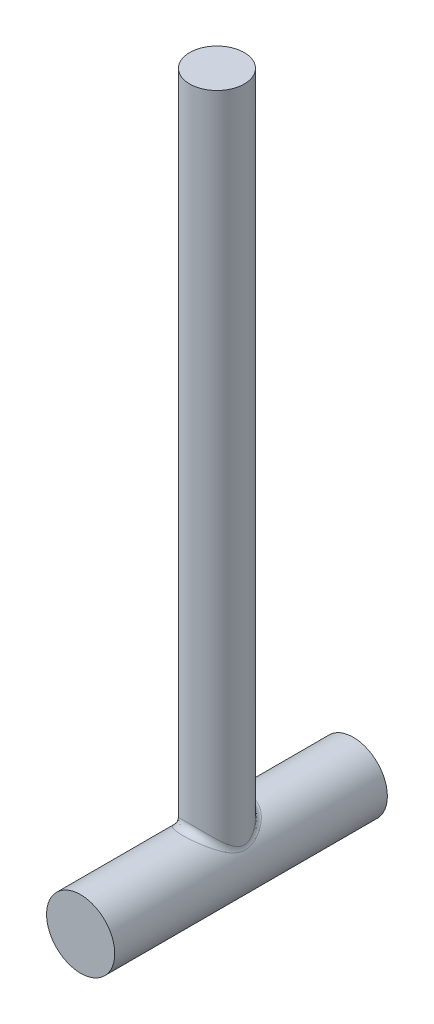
ISO-10303-21;
HEADER;
FILE_DESCRIPTION(('STEP AP214'),'2;1');
FILE_NAME('part.step','',(''),(''),'','','');
FILE_SCHEMA(('AUTOMOTIVE_DESIGN { 1 0 10303 214 1 1 1 1 }'));
ENDSEC;
DATA;
#1=APPLICATION_CONTEXT('core data for automotive mechanical design processes');
#2=APPLICATION_PROTOCOL_DEFINITION('international standard','automotive_design',2000,#1);
#3=PRODUCT_CONTEXT('',#1,'mechanical');
#4=PRODUCT('Part','Part','',(#3));
#5=PRODUCT_RELATED_PRODUCT_CATEGORY('part','',(#4));
#6=PRODUCT_DEFINITION_FORMATION('','',#4);
#7=PRODUCT_DEFINITION_CONTEXT('part definition',#1,'design');
#8=PRODUCT_DEFINITION('design','',#6,#7);
#9=PRODUCT_DEFINITION_SHAPE('','',#8);
#10=(LENGTH_UNIT() NAMED_UNIT(*) SI_UNIT(.MILLI.,.METRE.));
#11=(NAMED_UNIT(*) PLANE_ANGLE_UNIT() SI_UNIT($,.RADIAN.));
#12=(NAMED_UNIT(*) SI_UNIT($,.STERADIAN.) SOLID_ANGLE_UNIT());
#13=UNCERTAINTY_MEASURE_WITH_UNIT(LENGTH_MEASURE(1.E-05),#10,'distance_accuracy_value','');
#14=(GEOMETRIC_REPRESENTATION_CONTEXT(3) GLOBAL_UNCERTAINTY_ASSIGNED_CONTEXT((#13)) GLOBAL_UNIT_ASSIGNED_CONTEXT((#10,
#11,#12)) REPRESENTATION_CONTEXT('',''));
#15=CARTESIAN_POINT('',(0.,0.,0.));
#16=DIRECTION('',(0.,0.,1.));
#17=DIRECTION('',(1.,0.,0.));
#18=AXIS2_PLACEMENT_3D('',#15,#16,#17);
#19=CARTESIAN_POINT('',(0.,0.,20.));
#20=DIRECTION('',(0.,0.,-1.));
#21=DIRECTION('',(-1.,0.,0.));
#22=AXIS2_PLACEMENT_3D('',#19,#20,#21);
#23=CYLINDRICAL_SURFACE('',#22,5.);
#24=CARTESIAN_POINT('',(-0.656376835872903,4.95672971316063,-4.93757065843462));
#25=CARTESIAN_POINT('',(-0.504697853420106,4.97681524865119,-3.97006442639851));
#26=CARTESIAN_POINT('',(-0.630121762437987,5.94807565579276,-3.95005652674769));
#27=CARTESIAN_POINT('',(-0.464223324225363,4.98217229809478,-4.97435039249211));
#28=CARTESIAN_POINT('',(-0.352663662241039,4.99094800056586,-3.98829545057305));
#29=CARTESIAN_POINT('',(-0.44565439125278,5.97860675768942,-3.97948031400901));
#30=CARTESIAN_POINT('',(-0.268443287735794,4.99664556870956,-4.99516905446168));
#31=CARTESIAN_POINT('',(-0.20403773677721,4.99825251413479,-3.99774188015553));
#32=CARTESIAN_POINT('',(-0.257705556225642,5.99597468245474,-3.99613524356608));
#33=CARTESIAN_POINT('',(0.123945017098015,5.00231038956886,-5.00332749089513));
#34=CARTESIAN_POINT('',(0.0944058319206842,5.00120638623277,-4.00155886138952));
#35=CARTESIAN_POINT('',(0.118987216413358,6.00277246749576,-4.00266199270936));
#36=CARTESIAN_POINT('',(0.320553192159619,4.99350449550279,-4.99067094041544));
#37=CARTESIAN_POINT('',(0.242548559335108,4.99682462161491,-3.99588917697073));
#38=CARTESIAN_POINT('',(0.307731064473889,5.99220539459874,-3.99253675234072));
#39=CARTESIAN_POINT('',(0.693096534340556,4.95499917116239,-4.93508987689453));
#40=CARTESIAN_POINT('',(0.531937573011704,4.97600469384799,-3.96901749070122));
#41=CARTESIAN_POINT('',(0.665372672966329,5.94599900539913,-3.9480719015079));
#42=CARTESIAN_POINT('',(0.86946167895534,4.92695177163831,-4.89455803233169));
#43=CARTESIAN_POINT('',(0.671445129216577,4.96071031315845,-3.94928942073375));
#44=CARTESIAN_POINT('',(0.834683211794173,5.91234212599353,-3.91564642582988));
#45=CARTESIAN_POINT('',(1.21303128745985,4.85380602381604,-4.78816065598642));
#46=CARTESIAN_POINT('',(0.954268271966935,4.91716770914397,-3.89313869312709));
#47=CARTESIAN_POINT('',(1.16451003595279,5.82456722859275,-3.83052852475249));
#48=CARTESIAN_POINT('',(1.38023434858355,4.80870507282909,-4.72229125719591));
#49=CARTESIAN_POINT('',(1.09657196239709,4.88927170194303,-3.85717007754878));
#50=CARTESIAN_POINT('',(1.32502497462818,5.77044608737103,-3.77783300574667));
#51=CARTESIAN_POINT('',(1.71349895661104,4.70070856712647,-4.56305720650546));
#52=CARTESIAN_POINT('',(1.39163167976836,4.81687698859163,-3.7634632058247));
#53=CARTESIAN_POINT('',(1.64495899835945,5.64085028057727,-3.65044576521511));
#54=CARTESIAN_POINT('',(1.87871059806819,4.6368119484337,-4.46812812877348));
#55=CARTESIAN_POINT('',(1.54391894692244,4.7718539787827,-3.7050335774));
#56=CARTESIAN_POINT('',(1.80356217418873,5.56417433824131,-3.57450250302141));
#57=CARTESIAN_POINT('',(2.19339683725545,4.49653032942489,-4.25665468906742));
#58=CARTESIAN_POINT('',(1.844386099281,4.66600158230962,-3.5661683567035));
#59=CARTESIAN_POINT('',(2.10566096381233,5.39583639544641,-3.40532375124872));
#60=CARTESIAN_POINT('',(2.34285964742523,4.42013608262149,-4.14009431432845));
#61=CARTESIAN_POINT('',(1.99232649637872,4.60567561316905,-3.48642403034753));
#62=CARTESIAN_POINT('',(2.24914526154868,5.30416329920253,-3.3120754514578));
#63=CARTESIAN_POINT('',(2.69256281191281,4.21991137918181,-3.82848401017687));
#64=CARTESIAN_POINT('',(2.34544449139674,4.44025322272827,-3.26396071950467));
#65=CARTESIAN_POINT('',(2.58486029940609,5.06389365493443,-3.06278720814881));
#66=CARTESIAN_POINT('',(2.88311381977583,4.09080894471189,-3.62248098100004));
#67=CARTESIAN_POINT('',(2.54804891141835,4.32699518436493,-3.10882273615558));
#68=CARTESIAN_POINT('',(2.7677892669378,4.90897073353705,-2.89798478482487));
#69=CARTESIAN_POINT('',(3.14141504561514,3.8914607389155,-3.28824676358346));
#70=CARTESIAN_POINT('',(2.83053667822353,4.14238582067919,-2.8430824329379));
#71=CARTESIAN_POINT('',(3.01575844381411,4.6697528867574,-2.63059741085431));
#72=CARTESIAN_POINT('',(3.22303514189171,3.82395088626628,-3.17242705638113));
#73=CARTESIAN_POINT('',(2.92035982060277,4.0791190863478,-2.75012904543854));
#74=CARTESIAN_POINT('',(3.09411373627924,4.58874106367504,-2.53794164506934));
#75=CARTESIAN_POINT('',(3.37711116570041,3.68857656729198,-2.93255606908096));
#76=CARTESIAN_POINT('',(3.09131895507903,3.95023691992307,-2.5545809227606));
#77=CARTESIAN_POINT('',(3.24202671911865,4.42629188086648,-2.34604485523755));
#78=CARTESIAN_POINT('',(3.44956975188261,3.62071220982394,-2.80850719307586));
#79=CARTESIAN_POINT('',(3.1726917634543,3.88458585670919,-2.45202973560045));
#80=CARTESIAN_POINT('',(3.31158696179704,4.34485465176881,-2.24680575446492));
#81=CARTESIAN_POINT('',(3.57163265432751,3.49989695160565,-2.57784890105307));
#82=CARTESIAN_POINT('',(3.31078213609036,3.76613114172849,-2.25873473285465));
#83=CARTESIAN_POINT('',(3.42876734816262,4.19987634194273,-2.06227912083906));
#84=CARTESIAN_POINT('',(3.62291047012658,3.44667595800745,-2.47270834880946));
#85=CARTESIAN_POINT('',(3.36916059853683,3.71346435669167,-2.16993669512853));
#86=CARTESIAN_POINT('',(3.47799405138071,4.13601114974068,-1.97816667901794));
#87=CARTESIAN_POINT('',(3.71938308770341,3.34233908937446,-2.25705321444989));
#88=CARTESIAN_POINT('',(3.47940570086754,3.60943635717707,-1.98639252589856));
#89=CARTESIAN_POINT('',(3.57060776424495,4.01080690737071,-1.80564257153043));
#90=CARTESIAN_POINT('',(3.76457924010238,3.29122274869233,-2.14653983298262));
#91=CARTESIAN_POINT('',(3.53139751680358,3.55800753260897,-1.89161323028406));
#92=CARTESIAN_POINT('',(3.61399607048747,3.94946729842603,-1.717231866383));
#93=CARTESIAN_POINT('',(3.84855281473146,3.19262027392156,-1.92014399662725));
#94=CARTESIAN_POINT('',(3.62825545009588,3.45823376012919,-1.69625625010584));
#95=CARTESIAN_POINT('',(3.69461070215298,3.83114432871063,-1.53611519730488));
#96=CARTESIAN_POINT('',(3.88734472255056,3.14512608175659,-1.80427443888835));
#97=CARTESIAN_POINT('',(3.67325600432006,3.40979809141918,-1.59563376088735));
#98=CARTESIAN_POINT('',(3.73185093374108,3.77415129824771,-1.44341955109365));
#99=CARTESIAN_POINT('',(3.95819959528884,3.05547343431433,-1.56682411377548));
#100=CARTESIAN_POINT('',(3.75558814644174,3.31799967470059,-1.38847188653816));
#101=CARTESIAN_POINT('',(3.79987161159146,3.66656812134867,-1.25345929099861));
#102=CARTESIAN_POINT('',(3.99026650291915,3.0133118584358,-1.4452467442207));
#103=CARTESIAN_POINT('',(3.79303666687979,3.2745350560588,-1.28184494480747));
#104=CARTESIAN_POINT('',(3.83065584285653,3.61597423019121,-1.15619739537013));
#105=CARTESIAN_POINT('',(4.05471659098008,2.92625159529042,-1.16278607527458));
#106=CARTESIAN_POINT('',(3.86828981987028,3.18464055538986,-1.03348311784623));
#107=CARTESIAN_POINT('',(3.89252792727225,3.51150191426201,-0.930228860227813));
#108=CARTESIAN_POINT('',(4.08489217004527,2.88363485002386,-1.00008441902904));
#109=CARTESIAN_POINT('',(3.90377520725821,3.14023922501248,-0.889490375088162));
#110=CARTESIAN_POINT('',(3.92149648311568,3.46036181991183,-0.800067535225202));
#111=CARTESIAN_POINT('',(4.12008241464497,2.83290390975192,-0.750345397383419));
#112=CARTESIAN_POINT('',(3.94516185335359,3.08731330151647,-0.667774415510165));
#113=CARTESIAN_POINT('',(3.95527911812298,3.39948469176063,-0.60027631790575));
#114=CARTESIAN_POINT('',(4.13013044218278,2.81819780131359,-0.666206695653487));
#115=CARTESIAN_POINT('',(3.9569845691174,3.07195234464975,-0.593034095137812));
#116=CARTESIAN_POINT('',(3.96492522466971,3.38183736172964,-0.532965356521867));
#117=CARTESIAN_POINT('',(4.14669097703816,2.79377397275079,-0.49641412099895));
#118=CARTESIAN_POINT('',(3.97646622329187,3.04643699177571,-0.442107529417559));
#119=CARTESIAN_POINT('',(3.98082333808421,3.35252876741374,-0.397131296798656));
#120=CARTESIAN_POINT('',(4.15320524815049,2.78405376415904,-0.410761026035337));
#121=CARTESIAN_POINT('',(3.98414214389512,3.03626092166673,-0.365867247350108));
#122=CARTESIAN_POINT('',(3.98707703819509,3.3408645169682,-0.328608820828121));
#123=CARTESIAN_POINT('',(4.16258609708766,2.77000910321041,-0.237748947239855));
#124=CARTESIAN_POINT('',(3.9951893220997,3.02156378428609,-0.211839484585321));
#125=CARTESIAN_POINT('',(3.9960826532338,3.32401092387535,-0.190199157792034));
#126=CARTESIAN_POINT('',(4.16541950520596,2.76573372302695,-0.150381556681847));
#127=CARTESIAN_POINT('',(3.99853052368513,3.01708213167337,-0.133981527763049));
#128=CARTESIAN_POINT('',(3.99880272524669,3.31888046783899,-0.120305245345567));
#129=CARTESIAN_POINT('',(4.16725397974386,2.76296889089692,0.0245414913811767));
#130=CARTESIAN_POINT('',(4.00069184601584,3.0141866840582,0.0218548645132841));
#131=CARTESIAN_POINT('',(4.00056382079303,3.31556266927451,0.0196331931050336));
#132=CARTESIAN_POINT('',(4.16625519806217,2.76447920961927,0.112097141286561));
#133=CARTESIAN_POINT('',(3.9995139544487,3.01577022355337,0.0998984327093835));
#134=CARTESIAN_POINT('',(3.99960499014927,3.31737505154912,0.0896777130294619));
#135=CARTESIAN_POINT('',(4.16044963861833,2.77320862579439,0.286676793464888));
#136=CARTESIAN_POINT('',(3.99267498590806,3.02490969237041,0.255390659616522));
#137=CARTESIAN_POINT('',(3.99403165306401,3.32785035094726,0.229341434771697));
#138=CARTESIAN_POINT('',(4.15564001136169,2.78043199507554,0.37370034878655));
#139=CARTESIAN_POINT('',(3.98700486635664,3.0324776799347,0.33290305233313));
#140=CARTESIAN_POINT('',(3.98941441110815,3.33651839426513,0.298960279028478));
#141=CARTESIAN_POINT('',(4.14233780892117,2.80020991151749,0.546480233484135));
#142=CARTESIAN_POINT('',(3.97134796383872,3.05315812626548,0.486617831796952));
#143=CARTESIAN_POINT('',(3.97664429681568,3.36025189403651,0.437184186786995));
#144=CARTESIAN_POINT('',(4.13384317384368,2.81276744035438,0.632235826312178));
#145=CARTESIAN_POINT('',(3.96134622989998,3.06629001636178,0.562878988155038));
#146=CARTESIAN_POINT('',(3.968489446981,3.37532092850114,0.505788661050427));
#147=CARTESIAN_POINT('',(4.09884570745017,2.86380854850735,0.921942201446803));
#148=CARTESIAN_POINT('',(3.92013701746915,3.11963040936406,0.820471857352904));
#149=CARTESIAN_POINT('',(3.93489187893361,3.43657025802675,0.737553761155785));
#150=CARTESIAN_POINT('',(4.06386231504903,2.91384586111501,1.12158455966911));
#151=CARTESIAN_POINT('',(3.87890366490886,3.17190992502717,0.997460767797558));
#152=CARTESIAN_POINT('',(3.90130782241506,3.49661503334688,0.89726764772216));
#153=CARTESIAN_POINT('',(3.97639037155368,3.0321053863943,1.50715033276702));
#154=CARTESIAN_POINT('',(3.77667649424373,3.29412827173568,1.33681627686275));
#155=CARTESIAN_POINT('',(3.81733475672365,3.63852646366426,1.20572026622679));
#156=CARTESIAN_POINT('',(3.92384370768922,3.10038781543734,1.69302566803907));
#157=CARTESIAN_POINT('',(3.71524182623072,3.36451649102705,1.49960183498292));
#158=CARTESIAN_POINT('',(3.76688995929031,3.72046537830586,1.35442053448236));
#159=CARTESIAN_POINT('',(3.81592361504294,3.23178170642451,2.01371198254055));
#160=CARTESIAN_POINT('',(3.59047177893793,3.49808565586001,1.77747705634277));
#161=CARTESIAN_POINT('',(3.6632866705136,3.8781380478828,1.61096958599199));
#162=CARTESIAN_POINT('',(3.76342756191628,3.29299946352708,2.15108553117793));
#163=CARTESIAN_POINT('',(3.52983452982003,3.56003795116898,1.89588354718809));
#164=CARTESIAN_POINT('',(3.61289045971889,3.95159935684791,1.72086842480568));
#165=CARTESIAN_POINT('',(3.64927498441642,3.41906735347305,2.41779299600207));
#166=CARTESIAN_POINT('',(3.39905895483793,3.68622850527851,2.12371548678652));
#167=CARTESIAN_POINT('',(3.50330398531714,4.10288082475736,1.93423439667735));
#168=CARTESIAN_POINT('',(3.58761353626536,3.48391942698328,2.54712253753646));
#169=CARTESIAN_POINT('',(3.32869111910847,3.75059911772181,2.23321016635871));
#170=CARTESIAN_POINT('',(3.44410899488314,4.18070331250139,2.03769803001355));
#171=CARTESIAN_POINT('',(3.45536271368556,3.61512878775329,2.79805652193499));
#172=CARTESIAN_POINT('',(3.17923813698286,3.8791316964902,2.44330082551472));
#173=CARTESIAN_POINT('',(3.31714820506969,4.33815454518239,2.23844521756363));
#174=CARTESIAN_POINT('',(3.38476585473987,3.68148729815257,2.91965435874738));
#175=CARTESIAN_POINT('',(3.09991770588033,3.94337976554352,2.54390844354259));
#176=CARTESIAN_POINT('',(3.2493752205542,4.41778475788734,2.33572348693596));
#177=CARTESIAN_POINT('',(3.23478076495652,3.81395148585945,3.15500675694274));
#178=CARTESIAN_POINT('',(2.93336321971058,4.06965310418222,2.73600419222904));
#179=CARTESIAN_POINT('',(3.10538953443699,4.5767417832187,2.52400540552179));
#180=CARTESIAN_POINT('',(3.15538921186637,3.88005705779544,3.26875832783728));
#181=CARTESIAN_POINT('',(2.84590576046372,4.13171405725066,2.82745331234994));
#182=CARTESIAN_POINT('',(3.02917364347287,4.65606846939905,2.61500666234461));
#183=CARTESIAN_POINT('',(2.89872531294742,4.07986379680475,3.6047983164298));
#184=CARTESIAN_POINT('',(2.56461215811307,4.31730678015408,3.09538255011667));
#185=CARTESIAN_POINT('',(2.78277630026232,4.89583655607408,2.88383865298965));
#186=CARTESIAN_POINT('',(2.70702246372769,4.2108177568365,3.81410095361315));
#187=CARTESIAN_POINT('',(2.36028397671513,4.43258032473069,3.25347768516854));
#188=CARTESIAN_POINT('',(2.5987415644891,5.05298130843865,3.05128076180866));
#189=CARTESIAN_POINT('',(2.28683155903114,4.45298177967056,4.19142523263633));
#190=CARTESIAN_POINT('',(1.93287136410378,4.63423873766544,3.52499216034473));
#191=CARTESIAN_POINT('',(2.19535829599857,5.34357813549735,3.35314018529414));
#192=CARTESIAN_POINT('',(2.05843347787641,4.56423877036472,4.35954536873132));
#193=CARTESIAN_POINT('',(1.70914838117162,4.71950185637,3.63668322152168));
#194=CARTESIAN_POINT('',(1.97609613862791,5.47708652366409,3.48763629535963));
#195=CARTESIAN_POINT('',(1.62242003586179,4.73386922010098,4.61237196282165));
#196=CARTESIAN_POINT('',(1.30802655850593,4.84065732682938,3.79439253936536));
#197=CARTESIAN_POINT('',(1.55752323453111,5.68064306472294,3.68989756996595));
#198=CARTESIAN_POINT('',(1.42146183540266,4.79850025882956,4.70731220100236));
#199=CARTESIAN_POINT('',(1.13096002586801,4.88270716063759,3.84867481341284));
#200=CARTESIAN_POINT('',(1.36460336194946,5.75820031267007,3.76584975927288));
#201=CARTESIAN_POINT('',(1.10850727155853,4.87676336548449,4.82158858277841));
#202=CARTESIAN_POINT('',(0.868441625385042,4.93090253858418,3.91085115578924));
#203=CARTESIAN_POINT('',(1.06416698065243,5.85211603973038,3.85727086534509));
#204=CARTESIAN_POINT('',(1.00229410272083,4.8997341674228,4.85498747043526));
#205=CARTESIAN_POINT('',(0.781042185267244,4.94447833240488,3.92835628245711));
#206=CARTESIAN_POINT('',(0.962202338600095,5.87968100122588,3.88398997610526));
#207=CARTESIAN_POINT('',(0.786826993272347,4.93891643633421,4.91182499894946));
#208=CARTESIAN_POINT('',(0.607034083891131,4.96706037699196,3.95747947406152));
#209=CARTESIAN_POINT('',(0.75535391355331,5.92669972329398,3.92945999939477));
#210=CARTESIAN_POINT('',(0.677573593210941,4.95512909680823,4.93526539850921));
#211=CARTESIAN_POINT('',(0.520681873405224,4.97599401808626,3.96900395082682));
#212=CARTESIAN_POINT('',(0.650470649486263,5.94615491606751,3.94821231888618));
#213=CARTESIAN_POINT('',(0.38210513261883,4.98884610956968,4.98396212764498));
#214=CARTESIAN_POINT('',(0.289813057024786,4.99439469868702,3.99275153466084));
#215=CARTESIAN_POINT('',(0.366820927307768,5.98661533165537,3.98716970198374));
#216=CARTESIAN_POINT('',(0.193926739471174,4.99977508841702,4.99967674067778));
#217=CARTESIAN_POINT('',(0.147426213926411,4.99988483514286,3.99985162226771));
#218=CARTESIAN_POINT('',(0.186169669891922,5.9997301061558,3.99974139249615));
#219=CARTESIAN_POINT('',(-0.182392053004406,5.00021825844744,5.00031367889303));
#220=CARTESIAN_POINT('',(-0.138675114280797,5.00011171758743,4.00014392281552));
#221=CARTESIAN_POINT('',(-0.175096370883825,6.0002619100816,4.00025094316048));
#222=CARTESIAN_POINT('',(-0.370532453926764,4.98973549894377,4.98524038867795));
#223=CARTESIAN_POINT('',(-0.280912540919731,4.99484767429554,3.9933351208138));
#224=CARTESIAN_POINT('',(-0.355711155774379,5.98768259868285,3.98819231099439));
#225=CARTESIAN_POINT('',(-0.740686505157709,4.94833235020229,4.9254547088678));
#226=CARTESIAN_POINT('',(-0.569349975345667,4.97235143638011,3.96430407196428));
#227=CARTESIAN_POINT('',(-0.711059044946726,5.9379988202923,3.94036376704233));
#228=CARTESIAN_POINT('',(-0.922713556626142,4.91746021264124,4.88081229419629));
#229=CARTESIAN_POINT('',(-0.714159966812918,4.95536659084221,3.94240065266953));
#230=CARTESIAN_POINT('',(-0.885805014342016,5.90095225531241,3.90464983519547));
#231=CARTESIAN_POINT('',(-1.27650855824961,4.83771390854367,4.76466995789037));
#232=CARTESIAN_POINT('',(-1.00773995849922,4.9072563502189,3.88035348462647));
#233=CARTESIAN_POINT('',(-1.22544821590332,5.80525669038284,3.81173596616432));
#234=CARTESIAN_POINT('',(-1.44827270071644,4.78883310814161,4.69316013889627));
#235=CARTESIAN_POINT('',(-1.15542577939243,4.87653733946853,3.84073390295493));
#236=CARTESIAN_POINT('',(-1.39034179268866,5.74659972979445,3.75452811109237));
#237=CARTESIAN_POINT('',(-1.78490504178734,4.67407387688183,4.52351612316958));
#238=CARTESIAN_POINT('',(-1.45685716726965,4.79822273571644,3.73923988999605));
#239=CARTESIAN_POINT('',(-1.71350884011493,5.60888865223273,3.61881289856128));
#240=CARTESIAN_POINT('',(-1.9492419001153,4.60760614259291,4.42445115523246));
#241=CARTESIAN_POINT('',(-1.61005001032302,4.75053566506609,3.67724101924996));
#242=CARTESIAN_POINT('',(-1.87127222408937,5.52912737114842,3.53956092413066));
#243=CARTESIAN_POINT('',(-2.26173611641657,4.46254624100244,4.20488465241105));
#244=CARTESIAN_POINT('',(-1.91145470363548,4.63934265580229,3.530942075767));
#245=CARTESIAN_POINT('',(-2.17126667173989,5.35505548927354,3.36390772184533));
#246=CARTESIAN_POINT('',(-2.40988225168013,4.38394575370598,4.08436839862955));
#247=CARTESIAN_POINT('',(-2.05949505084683,4.57633632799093,3.44733612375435));
#248=CARTESIAN_POINT('',(-2.31348696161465,5.26073490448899,3.26749471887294));
#249=CARTESIAN_POINT('',(-2.75645893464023,4.17846550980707,3.76262091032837));
#250=CARTESIAN_POINT('',(-2.4123444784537,4.40439941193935,3.21490200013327));
#251=CARTESIAN_POINT('',(-2.64620057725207,5.01415861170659,3.01009672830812));
#252=CARTESIAN_POINT('',(-2.94491587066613,4.04651453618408,3.5504047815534));
#253=CARTESIAN_POINT('',(-2.61421183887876,4.28728427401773,3.05335617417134));
#254=CARTESIAN_POINT('',(-2.82711923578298,4.8558174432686,2.84032382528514));
#255=CARTESIAN_POINT('',(-3.19948763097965,3.84384807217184,3.20666589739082));
#256=CARTESIAN_POINT('',(-2.89424280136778,4.09790611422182,2.77775691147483));
#257=CARTESIAN_POINT('',(-3.07150812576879,4.61261768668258,2.56533271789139));
#258=CARTESIAN_POINT('',(-3.27975654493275,3.77539839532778,3.08765663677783));
#259=CARTESIAN_POINT('',(-2.9830531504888,4.03321917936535,2.681499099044));
#260=CARTESIAN_POINT('',(-3.14856628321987,4.53047807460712,2.47012530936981));
#261=CARTESIAN_POINT('',(-3.43092302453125,3.63856004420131,2.84126930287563));
#262=CARTESIAN_POINT('',(-3.15158971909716,3.90196555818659,2.4792340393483));
#263=CARTESIAN_POINT('',(-3.29368610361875,4.36627205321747,2.27301544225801));
#264=CARTESIAN_POINT('',(-3.50182373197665,3.57017135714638,2.71389405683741));
#265=CARTESIAN_POINT('',(-3.23156405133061,3.83534791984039,2.37325715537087));
#266=CARTESIAN_POINT('',(-3.36175078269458,4.28420562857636,2.17111524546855));
#267=CARTESIAN_POINT('',(-3.61789408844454,3.45194682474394,2.48295740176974));
#268=CARTESIAN_POINT('',(-3.36342515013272,3.71868838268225,2.17856609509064));
#269=CARTESIAN_POINT('',(-3.47317832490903,4.1423361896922,1.98636592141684));
#270=CARTESIAN_POINT('',(-3.66511484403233,3.40166589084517,2.38119523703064));
#271=CARTESIAN_POINT('',(-3.41735261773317,3.66867587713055,2.0922073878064));
#272=CARTESIAN_POINT('',(-3.51851025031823,4.08199906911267,1.90495618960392));
#273=CARTESIAN_POINT('',(-3.75397276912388,3.30334260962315,2.17273494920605));
#274=CARTESIAN_POINT('',(-3.51917140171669,3.57022124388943,1.91407509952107));
#275=CARTESIAN_POINT('',(-3.60381385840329,3.96401113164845,1.73818795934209));
#276=CARTESIAN_POINT('',(-3.79561127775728,3.25529972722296,2.06603801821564));
#277=CARTESIAN_POINT('',(-3.56717079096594,3.52171589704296,1.82226702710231));
#278=CARTESIAN_POINT('',(-3.64378682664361,3.90635967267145,1.65283041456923));
#279=CARTESIAN_POINT('',(-3.87298136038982,3.16285319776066,1.8477158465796));
#280=CARTESIAN_POINT('',(-3.65657349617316,3.42790027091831,1.63336908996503));
#281=CARTESIAN_POINT('',(-3.7180621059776,3.7954238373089,1.47817267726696));
#282=CARTESIAN_POINT('',(-3.9087258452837,3.11844170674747,1.73610207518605));
#283=CARTESIAN_POINT('',(-3.69809291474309,3.38250715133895,1.53623500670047));
#284=CARTESIAN_POINT('',(-3.75237681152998,3.74213004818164,1.38888166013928));
#285=CARTESIAN_POINT('',(-3.97400963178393,3.0348079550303,1.50765703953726));
#286=CARTESIAN_POINT('',(-3.77403750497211,3.29671511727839,1.33659129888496));
#287=CARTESIAN_POINT('',(-3.81504924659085,3.64176954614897,1.20612563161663));
#288=CARTESIAN_POINT('',(-4.00355211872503,2.99558303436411,1.39082849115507));
#289=CARTESIAN_POINT('',(-3.80856261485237,3.25622606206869,1.23399999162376));
#290=CARTESIAN_POINT('',(-3.84341003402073,3.594699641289,1.11266279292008));
#291=CARTESIAN_POINT('',(-4.06430635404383,2.9128741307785,1.11345498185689));
#292=CARTESIAN_POINT('',(-3.87953902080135,3.17074418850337,0.989898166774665));
#293=CARTESIAN_POINT('',(-3.90173409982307,3.49544895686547,0.890763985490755));
#294=CARTESIAN_POINT('',(-4.09302472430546,2.8720467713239,0.950888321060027));
#295=CARTESIAN_POINT('',(-3.91332737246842,3.12817194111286,0.845914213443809));
#296=CARTESIAN_POINT('',(-3.92930373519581,3.446456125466,0.760710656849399));
#297=CARTESIAN_POINT('',(-4.12603504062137,2.82421822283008,0.701632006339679));
#298=CARTESIAN_POINT('',(-3.95216153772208,3.07824787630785,0.624522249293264));
#299=CARTESIAN_POINT('',(-3.96099363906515,3.38906186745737,0.561305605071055));
#300=CARTESIAN_POINT('',(-4.13535799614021,2.8105150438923,0.617698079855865));
#301=CARTESIAN_POINT('',(-3.96313432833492,3.06392750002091,0.549929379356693));
#302=CARTESIAN_POINT('',(-3.9699436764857,3.37261805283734,0.494158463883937));
#303=CARTESIAN_POINT('',(-4.15048007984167,2.78813545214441,0.448434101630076));
#304=CARTESIAN_POINT('',(-3.98092802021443,3.04053859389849,0.39941753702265));
#305=CARTESIAN_POINT('',(-3.98446087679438,3.34576254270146,0.358747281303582));
#306=CARTESIAN_POINT('',(-4.15628094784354,2.7794565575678,0.363104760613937));
#307=CARTESIAN_POINT('',(-3.98776455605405,3.0314499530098,0.323444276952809));
#308=CARTESIAN_POINT('',(-3.99002970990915,3.33534786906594,0.290483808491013));
#309=CARTESIAN_POINT('',(-4.16425143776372,2.76750124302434,0.190959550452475));
#310=CARTESIAN_POINT('',(-3.99715205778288,3.01893661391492,0.170158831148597));
#311=CARTESIAN_POINT('',(-3.997681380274,3.32100149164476,0.152767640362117));
#312=CARTESIAN_POINT('',(-4.16639145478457,2.76426887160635,0.104137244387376));
#313=CARTESIAN_POINT('',(-3.99967573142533,3.01554794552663,0.0927787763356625));
#314=CARTESIAN_POINT('',(-3.99973579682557,3.3171226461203,0.0833097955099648));
#315=CARTESIAN_POINT('',(-4.16689205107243,2.76351422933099,-0.0695562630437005));
#316=CARTESIAN_POINT('',(-4.00026554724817,3.01475763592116,-0.0619660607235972));
#317=CARTESIAN_POINT('',(-4.00021636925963,3.31621707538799,-0.0556450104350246));
#318=CARTESIAN_POINT('',(-4.16525273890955,2.76599179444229,-0.156427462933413));
#319=CARTESIAN_POINT('',(-3.9983323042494,3.01735516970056,-0.139394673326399));
#320=CARTESIAN_POINT('',(-3.99864262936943,3.31919015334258,-0.12514197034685));
#321=CARTESIAN_POINT('',(-4.15823470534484,2.77653080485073,-0.329537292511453));
#322=CARTESIAN_POINT('',(-3.99006578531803,3.02838758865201,-0.293557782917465));
#323=CARTESIAN_POINT('',(-3.99190531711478,3.33183696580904,-0.263629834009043));
#324=CARTESIAN_POINT('',(-4.15285261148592,2.7845972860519,-0.415775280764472));
#325=CARTESIAN_POINT('',(-3.98372179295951,3.03683671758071,-0.370353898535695));
#326=CARTESIAN_POINT('',(-3.98673850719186,3.34151674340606,-0.332620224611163));
#327=CARTESIAN_POINT('',(-4.13848494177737,2.80590551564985,-0.586900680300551));
#328=CARTESIAN_POINT('',(-3.96681369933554,3.05911125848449,-0.522556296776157));
#329=CARTESIAN_POINT('',(-3.97294554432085,3.36708661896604,-0.469520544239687));
#330=CARTESIAN_POINT('',(-4.12949734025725,2.81915017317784,-0.67178730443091));
#331=CARTESIAN_POINT('',(-3.95623399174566,3.07295683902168,-0.598019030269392));
#332=CARTESIAN_POINT('',(-3.96431744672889,3.38298020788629,-0.53742984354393));
#333=CARTESIAN_POINT('',(-4.09233288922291,2.87315002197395,-0.963356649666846));
#334=CARTESIAN_POINT('',(-3.91247889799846,3.12937069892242,-0.857199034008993));
#335=CARTESIAN_POINT('',(-3.92863957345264,3.4477800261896,-0.770685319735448));
#336=CARTESIAN_POINT('',(-4.05538054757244,2.9257073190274,-1.16544706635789));
#337=CARTESIAN_POINT('',(-3.86893777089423,3.18424462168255,-1.03624163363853));
#338=CARTESIAN_POINT('',(-3.8931653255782,3.51084878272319,-0.932357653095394));
#339=CARTESIAN_POINT('',(-3.98661470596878,3.01800960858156,-1.45750094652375));
#340=CARTESIAN_POINT('',(-3.78882243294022,3.27931433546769,-1.29242457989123));
#341=CARTESIAN_POINT('',(-3.82715011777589,3.62161153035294,-1.16600075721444));
#342=CARTESIAN_POINT('',(-3.96140541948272,3.05110192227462,-1.55318713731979));
#343=CARTESIAN_POINT('',(-3.7594034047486,3.31340529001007,-1.37631926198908));
#344=CARTESIAN_POINT('',(-3.80294920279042,3.66132230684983,-1.24254970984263));
#345=CARTESIAN_POINT('',(-3.90679871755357,3.12071820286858,-1.74098403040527));
#346=CARTESIAN_POINT('',(-3.69590763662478,3.38476720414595,-1.54032752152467));
#347=CARTESIAN_POINT('',(-3.75052676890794,3.74486184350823,-1.39278722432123));
#348=CARTESIAN_POINT('',(-3.87740242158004,3.15724125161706,-1.83309568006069));
#349=CARTESIAN_POINT('',(-3.66177756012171,3.42208643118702,-1.62048900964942));
#350=CARTESIAN_POINT('',(-3.72230632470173,3.78868950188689,-1.46647654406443));
#351=CARTESIAN_POINT('',(-3.79662194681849,3.25447718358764,-2.06570561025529));
#352=CARTESIAN_POINT('',(-3.56818186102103,3.52107063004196,-1.82236417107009));
#353=CARTESIAN_POINT('',(-3.64475706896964,3.90537262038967,-1.65256448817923));
#354=CARTESIAN_POINT('',(-3.74230380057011,3.31703899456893,-2.20362093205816));
#355=CARTESIAN_POINT('',(-3.50552221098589,3.58424984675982,-1.94100045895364));
#356=CARTESIAN_POINT('',(-3.59261164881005,3.98044679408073,-1.76289674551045));
#357=CARTESIAN_POINT('',(-3.624359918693,3.44552454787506,-2.47125473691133));
#358=CARTESIAN_POINT('',(-3.3706216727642,3.71253382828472,-2.1690799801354));
#359=CARTESIAN_POINT('',(-3.47938552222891,4.13462945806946,-1.97700378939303));
#360=CARTESIAN_POINT('',(-3.56072930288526,3.51145004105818,-2.60096887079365));
#361=CARTESIAN_POINT('',(-3.29814295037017,3.77776893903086,-2.27858671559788));
#362=CARTESIAN_POINT('',(-3.41830013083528,4.21374004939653,-2.08077509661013));
#363=CARTESIAN_POINT('',(-3.42434470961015,3.64457825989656,-2.85252423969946));
#364=CARTESIAN_POINT('',(-3.14436841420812,3.90771510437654,-2.48849691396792));
#365=CARTESIAN_POINT('',(-3.28737092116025,4.37349391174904,-2.28201939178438));
#366=CARTESIAN_POINT('',(-3.35158237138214,3.71178210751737,-2.97435810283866));
#367=CARTESIAN_POINT('',(-3.06282868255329,3.97250797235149,-2.5889038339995));
#368=CARTESIAN_POINT('',(-3.21751907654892,4.45413852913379,-2.37948648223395));
#369=CARTESIAN_POINT('',(-3.19706603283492,3.84567805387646,-3.20996836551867));
#370=CARTESIAN_POINT('',(-2.89178030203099,4.09952600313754,-2.780338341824));
#371=CARTESIAN_POINT('',(-3.06918339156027,4.61481366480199,-2.56797469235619));
#372=CARTESIAN_POINT('',(-3.11530879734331,3.912369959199,-3.32374184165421));
#373=CARTESIAN_POINT('',(-2.80204304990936,4.16177946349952,-2.87131672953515));
#374=CARTESIAN_POINT('',(-2.9906964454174,4.69484395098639,-2.65899347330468));
#375=CARTESIAN_POINT('',(-2.85181181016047,4.11299462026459,-3.65852047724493));
#376=CARTESIAN_POINT('',(-2.51444200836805,4.34692930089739,-3.13663713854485));
#377=CARTESIAN_POINT('',(-2.73773933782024,4.93559354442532,-2.92681638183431));
#378=CARTESIAN_POINT('',(-2.65546579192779,4.24376093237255,-3.86624690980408));
#379=CARTESIAN_POINT('',(-2.30630250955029,4.46096614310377,-3.29217726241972));
#380=CARTESIAN_POINT('',(-2.54924716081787,5.09251312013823,-3.09299752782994));
#381=CARTESIAN_POINT('',(-2.22558508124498,4.48408783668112,-4.23884390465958));
#382=CARTESIAN_POINT('',(-1.87229371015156,4.65885264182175,-3.55749362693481));
#383=CARTESIAN_POINT('',(-2.13656167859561,5.38090540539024,-3.39107512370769));
#384=CARTESIAN_POINT('',(-1.99217553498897,4.59371713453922,-4.40385393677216));
#385=CARTESIAN_POINT('',(-1.64593408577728,4.74150350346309,-3.66546596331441));
#386=CARTESIAN_POINT('',(-1.91248851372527,5.51246056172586,-3.52308314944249));
#387=CARTESIAN_POINT('',(-1.57408131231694,4.74916021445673,-4.63480948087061));
#388=CARTESIAN_POINT('',(-1.26598644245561,4.85046500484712,-3.8070305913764));
#389=CARTESIAN_POINT('',(-1.51111805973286,5.69899225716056,-3.7078475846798));
#390=CARTESIAN_POINT('',(-1.39843980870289,4.80411775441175,-4.71550319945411));
#391=CARTESIAN_POINT('',(-1.11201153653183,4.88608160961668,-3.85301972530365));
#392=CARTESIAN_POINT('',(-1.34250221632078,5.76494130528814,-3.77240255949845));
#393=CARTESIAN_POINT('',(-1.03518171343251,4.89523719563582,-4.84857440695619));
#394=CARTESIAN_POINT('',(-0.805558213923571,4.94255135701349,-3.92588749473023));
#395=CARTESIAN_POINT('',(-0.993774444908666,5.87428463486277,-3.87885952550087));
#396=CARTESIAN_POINT('',(-0.847574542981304,4.93141368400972,-4.90097387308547));
#397=CARTESIAN_POINT('',(-0.654197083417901,4.96291814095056,-3.95213737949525));
#398=CARTESIAN_POINT('',(-0.813671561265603,5.91769642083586,-3.92077909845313));
#399=CARTESIAN_POINT('',(-0.656376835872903,4.95672971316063,-4.93757065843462));
#400=CARTESIAN_POINT('',(-0.504697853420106,4.97681524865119,-3.97006442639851));
#401=CARTESIAN_POINT('',(-0.630121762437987,5.94807565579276,-3.95005652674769));
#402=(BOUNDED_SURFACE() B_SPLINE_SURFACE(3,2,((#24,#25,#26),(#27,#28,#29),(#30,#31,#32),(#33,
#34,#35),(#36,#37,#38),(#39,#40,#41),(#42,#43,#44),(#45,#46,#47),(#48,#49,#50),(#51,#52,#53),
(#54,#55,#56),(#57,#58,#59),(#60,#61,#62),(#63,#64,#65),(#66,#67,#68),(#69,#70,#71),(#72,#73,
#74),(#75,#76,#77),(#78,#79,#80),(#81,#82,#83),(#84,#85,#86),(#87,#88,#89),(#90,#91,#92),(#93,
#94,#95),(#96,#97,#98),(#99,#100,#101),(#102,#103,#104),(#105,#106,#107),(#108,#109,#110),(#111,
#112,#113),(#114,#115,#116),(#117,#118,#119),(#120,#121,#122),(#123,#124,#125),(#126,#127,#128),
(#129,#130,#131),(#132,#133,#134),(#135,#136,#137),(#138,#139,#140),(#141,#142,#143),(#144,#145,
#146),(#147,#148,#149),(#150,#151,#152),(#153,#154,#155),(#156,#157,#158),(#159,#160,#161),
(#162,#163,#164),(#165,#166,#167),(#168,#169,#170),(#171,#172,#173),(#174,#175,#176),(#177,#178,
#179),(#180,#181,#182),(#183,#184,#185),(#186,#187,#188),(#189,#190,#191),(#192,#193,#194),
(#195,#196,#197),(#198,#199,#200),(#201,#202,#203),(#204,#205,#206),(#207,#208,#209),(#210,#211,
#212),(#213,#214,#215),(#216,#217,#218),(#219,#220,#221),(#222,#223,#224),(#225,#226,#227),
(#228,#229,#230),(#231,#232,#233),(#234,#235,#236),(#237,#238,#239),(#240,#241,#242),(#243,#244,
#245),(#246,#247,#248),(#249,#250,#251),(#252,#253,#254),(#255,#256,#257),(#258,#259,#260),
(#261,#262,#263),(#264,#265,#266),(#267,#268,#269),(#270,#271,#272),(#273,#274,#275),(#276,#277,
#278),(#279,#280,#281),(#282,#283,#284),(#285,#286,#287),(#288,#289,#290),(#291,#292,#293),
(#294,#295,#296),(#297,#298,#299),(#300,#301,#302),(#303,#304,#305),(#306,#307,#308),(#309,#310,
#311),(#312,#313,#314),(#315,#316,#317),(#318,#319,#320),(#321,#322,#323),(#324,#325,#326),
(#327,#328,#329),(#330,#331,#332),(#333,#334,#335),(#336,#337,#338),(#339,#340,#341),(#342,#343,
#344),(#345,#346,#347),(#348,#349,#350),(#351,#352,#353),(#354,#355,#356),(#357,#358,#359),
(#360,#361,#362),(#363,#364,#365),(#366,#367,#368),(#369,#370,#371),(#372,#373,#374),(#375,#376,
#377),(#378,#379,#380),(#381,#382,#383),(#384,#385,#386),(#387,#388,#389),(#390,#391,#392),
(#393,#394,#395),(#396,#397,#398),(#399,#400,#401)),.UNSPECIFIED.,.T.,.F.,
.F.) B_SPLINE_SURFACE_WITH_KNOTS((4,2,2,2,2,2,2,2,2,2,2,2,2,2,2,2,2,2,2,2,2,2,2,2,2,2,2,2,2,2,2,
2,2,2,2,2,2,2,2,2,2,2,2,2,2,2,2,2,2,2,2,2,2,2,2,2,2,2,2,2,2,2,4),(3,3),(0.,0.705541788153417,
1.4110061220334,2.06243452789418,2.71396239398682,3.40977056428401,4.1060958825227,
5.13383226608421,5.64933447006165,6.1646867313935,6.57705185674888,6.9893252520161,
7.40065296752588,7.81173885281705,8.33273201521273,8.59289740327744,8.85293281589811,
9.11529561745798,9.37764801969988,9.64019677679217,9.90289248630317,10.5369913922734,
11.1732095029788,11.6766816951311,12.1804253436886,12.6845937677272,13.1889532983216,
14.2287829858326,15.2661009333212,16.072947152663,16.4761933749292,16.8793683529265,
17.5558655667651,18.2322664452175,18.9070723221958,19.5821270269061,20.2835469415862,
20.9854500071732,22.0240928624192,22.5449487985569,23.0656296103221,23.4589065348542,
23.8520889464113,24.2443983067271,24.6365056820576,25.154141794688,25.4126463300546,
25.6710230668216,25.9314795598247,26.1919285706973,26.4526125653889,26.7134432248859,
27.3581049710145,27.681744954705,28.0052985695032,28.5146188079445,29.0242069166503,
29.5342650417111,30.0445072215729,31.0921910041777,32.1364096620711,32.8389884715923,
33.5410207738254),(0.,1.),
.UNSPECIFIED.) GEOMETRIC_REPRESENTATION_ITEM() RATIONAL_B_SPLINE_SURFACE(((1.,0.714380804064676,
1.),(1.,0.710145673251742,1.),(1.,0.707675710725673,1.),(1.,0.706715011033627,1.),(1.,
0.708223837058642,1.),(1.,0.7146799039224,1.),(1.,0.719354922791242,1.),(1.,0.731190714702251,
1.),(1.,0.738351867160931,1.),(1.,0.754868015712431,1.),(1.,0.764339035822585,1.),(1.,
0.784198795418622,1.),(1.,0.794588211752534,1.),(1.,0.820479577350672,1.),(1.,0.836061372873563,
1.),(1.,0.858326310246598,1.),(1.,0.865573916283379,1.),(1.,0.879558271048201,1.),(1.,
0.886295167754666,1.),(1.,0.897838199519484,1.),(1.,0.902761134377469,1.),(1.,0.912128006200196,
1.),(1.,0.916572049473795,1.),(1.,0.924904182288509,1.),(1.,0.92879352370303,1.),(1.,
0.935948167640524,1.),(1.,0.939213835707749,1.),(1.,0.94581168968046,1.),(1.,0.948928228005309,
1.),(1.,0.952575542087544,1.),(1.,0.953619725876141,1.),(1.,0.955342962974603,1.),(1.,
0.956022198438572,1.),(1.,0.957000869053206,1.),(1.,0.957296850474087,1.),(1.,0.95748844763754,
1.),(1.,0.957384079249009,1.),(1.,0.95677796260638,1.),(1.,0.956275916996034,1.),(1.,
0.954889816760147,1.),(1.,0.954005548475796,1.),(1.,0.950370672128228,1.),(1.,0.946748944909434,
1.),(1.,0.93779235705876,1.),(1.,0.932451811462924,1.),(1.,0.921650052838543,1.),(1.,
0.916446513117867,1.),(1.,0.905298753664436,1.),(1.,0.899354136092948,1.),(1.,0.886838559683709,
1.),(1.,0.880267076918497,1.),(1.,0.866627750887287,1.),(1.,0.85955972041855,1.),(1.,
0.837354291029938,1.),(1.,0.821616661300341,1.),(1.,0.790377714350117,1.),(1.,0.774875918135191,
1.),(1.,0.74995245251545,1.),(1.,0.739945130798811,1.),(1.,0.727493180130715,1.),(1.,
0.723769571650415,1.),(1.,0.717349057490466,1.),(1.,0.714651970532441,1.),(1.,0.709013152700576,
1.),(1.,0.707145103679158,1.),(1.,0.707069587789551,1.),(1.,0.708861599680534,1.),(1.,
0.71579112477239,1.),(1.,0.72092073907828,1.),(1.,0.733753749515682,1.),(1.,0.74145809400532,
1.),(1.,0.758835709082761,1.),(1.,0.768574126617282,1.),(1.,0.788851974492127,1.),(1.,
0.799391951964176,1.),(1.,0.82556951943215,1.),(1.,0.841226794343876,1.),(1.,0.863462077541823,
1.),(1.,0.870675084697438,1.),(1.,0.884544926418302,1.),(1.,0.891201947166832,1.),(1.,
0.902276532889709,1.),(1.,0.906843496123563,1.),(1.,0.915525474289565,1.),(1.,0.919640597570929,
1.),(1.,0.927350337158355,1.),(1.,0.930946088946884,1.),(1.,0.937556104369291,1.),(1.,
0.940570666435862,1.),(1.,0.946799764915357,1.),(1.,0.949769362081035,1.),(1.,0.953193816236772,
1.),(1.,0.954163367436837,1.),(1.,0.955737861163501,1.),(1.,0.956342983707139,1.),(1.,
0.957174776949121,1.),(1.,0.957398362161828,1.),(1.,0.957450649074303,1.),(1.,0.9572793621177,
1.),(1.,0.95654681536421,1.),(1.,0.955985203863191,1.),(1.,0.954488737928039,1.),(1.,
0.95355367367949,1.),(1.,0.949696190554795,1.),(1.,0.945874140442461,1.),(1.,0.938843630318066,
1.),(1.,0.936277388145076,1.),(1.,0.93075428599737,1.),(1.,0.92779753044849,1.),(1.,
0.919733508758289,1.),(1.,0.914366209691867,1.),(1.,0.902891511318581,1.),(1.,0.8967837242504,
1.),(1.,0.883943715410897,1.),(1.,0.877210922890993,1.),(1.,0.863258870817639,1.),(1.,
0.856039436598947,1.),(1.,0.833460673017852,1.),(1.,0.81753717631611,1.),(1.,0.78614351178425,
1.),(1.,0.770672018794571,1.),(1.,0.74758102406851,1.),(1.,0.73904866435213,1.),(1.,
0.724556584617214,1.),(1.,0.718594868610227,1.),(1.,0.714380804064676,1.))) REPRESENTATION_ITEM('') SURFACE());
#403=CARTESIAN_POINT('',(-0.656376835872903,4.95672971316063,-4.93757065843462));
#404=CARTESIAN_POINT('',(-0.464223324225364,4.98217229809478,-4.97435039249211));
#405=CARTESIAN_POINT('',(-0.268443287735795,4.99664556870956,-4.99516905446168));
#406=CARTESIAN_POINT('',(0.123945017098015,5.00231038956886,-5.00332749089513));
#407=CARTESIAN_POINT('',(0.320553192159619,4.99350449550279,-4.99067094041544));
#408=CARTESIAN_POINT('',(0.693096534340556,4.95499917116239,-4.93508987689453));
#409=CARTESIAN_POINT('',(0.86946167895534,4.92695177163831,-4.89455803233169));
#410=CARTESIAN_POINT('',(1.21303128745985,4.85380602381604,-4.78816065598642));
#411=CARTESIAN_POINT('',(1.38023434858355,4.80870507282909,-4.72229125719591));
#412=CARTESIAN_POINT('',(1.71349895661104,4.70070856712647,-4.56305720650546));
#413=CARTESIAN_POINT('',(1.87871059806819,4.6368119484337,-4.46812812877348));
#414=CARTESIAN_POINT('',(2.19339683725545,4.49653032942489,-4.25665468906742));
#415=CARTESIAN_POINT('',(2.34285964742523,4.42013608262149,-4.14009431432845));
#416=CARTESIAN_POINT('',(2.69256281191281,4.21991137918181,-3.82848401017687));
#417=CARTESIAN_POINT('',(2.88311381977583,4.09080894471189,-3.62248098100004));
#418=CARTESIAN_POINT('',(3.14141504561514,3.8914607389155,-3.28824676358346));
#419=CARTESIAN_POINT('',(3.22303514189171,3.82395088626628,-3.17242705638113));
#420=CARTESIAN_POINT('',(3.37711116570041,3.68857656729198,-2.93255606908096));
#421=CARTESIAN_POINT('',(3.44956975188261,3.62071220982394,-2.80850719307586));
#422=CARTESIAN_POINT('',(3.57163265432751,3.49989695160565,-2.57784890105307));
#423=CARTESIAN_POINT('',(3.62291047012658,3.44667595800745,-2.47270834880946));
#424=CARTESIAN_POINT('',(3.71938308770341,3.34233908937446,-2.25705321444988));
#425=CARTESIAN_POINT('',(3.76457924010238,3.29122274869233,-2.14653983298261));
#426=CARTESIAN_POINT('',(3.84855281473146,3.19262027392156,-1.92014399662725));
#427=CARTESIAN_POINT('',(3.88734472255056,3.14512608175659,-1.80427443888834));
#428=CARTESIAN_POINT('',(3.95819959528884,3.05547343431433,-1.56682411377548));
#429=CARTESIAN_POINT('',(3.99026650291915,3.0133118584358,-1.4452467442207));
#430=CARTESIAN_POINT('',(4.05471659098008,2.92625159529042,-1.16278607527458));
#431=CARTESIAN_POINT('',(4.08489217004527,2.88363485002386,-1.00008441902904));
#432=CARTESIAN_POINT('',(4.12008241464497,2.83290390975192,-0.750345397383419));
#433=CARTESIAN_POINT('',(4.13013044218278,2.81819780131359,-0.666206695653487));
#434=CARTESIAN_POINT('',(4.14669097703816,2.79377397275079,-0.49641412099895));
#435=CARTESIAN_POINT('',(4.15320524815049,2.78405376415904,-0.410761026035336));
#436=CARTESIAN_POINT('',(4.16258609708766,2.77000910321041,-0.237748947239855));
#437=CARTESIAN_POINT('',(4.16541950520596,2.76573372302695,-0.150381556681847));
#438=CARTESIAN_POINT('',(4.16725397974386,2.76296889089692,0.0245414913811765));
#439=CARTESIAN_POINT('',(4.16625519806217,2.76447920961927,0.112097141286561));
#440=CARTESIAN_POINT('',(4.16044963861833,2.77320862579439,0.286676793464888));
#441=CARTESIAN_POINT('',(4.15564001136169,2.78043199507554,0.37370034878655));
#442=CARTESIAN_POINT('',(4.14233780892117,2.80020991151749,0.546480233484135));
#443=CARTESIAN_POINT('',(4.13384317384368,2.81276744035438,0.632235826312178));
#444=CARTESIAN_POINT('',(4.09884570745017,2.86380854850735,0.921942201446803));
#445=CARTESIAN_POINT('',(4.06386231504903,2.91384586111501,1.12158455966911));
#446=CARTESIAN_POINT('',(3.97639037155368,3.0321053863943,1.50715033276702));
#447=CARTESIAN_POINT('',(3.92384370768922,3.10038781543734,1.69302566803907));
#448=CARTESIAN_POINT('',(3.81592361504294,3.23178170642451,2.01371198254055));
#449=CARTESIAN_POINT('',(3.76342756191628,3.29299946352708,2.15108553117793));
#450=CARTESIAN_POINT('',(3.64927498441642,3.41906735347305,2.41779299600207));
#451=CARTESIAN_POINT('',(3.58761353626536,3.48391942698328,2.54712253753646));
#452=CARTESIAN_POINT('',(3.45536271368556,3.61512878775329,2.79805652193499));
#453=CARTESIAN_POINT('',(3.38476585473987,3.68148729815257,2.91965435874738));
#454=CARTESIAN_POINT('',(3.23478076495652,3.81395148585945,3.15500675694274));
#455=CARTESIAN_POINT('',(3.15538921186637,3.88005705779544,3.26875832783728));
#456=CARTESIAN_POINT('',(2.89872531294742,4.07986379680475,3.6047983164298));
#457=CARTESIAN_POINT('',(2.70702246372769,4.2108177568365,3.81410095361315));
#458=CARTESIAN_POINT('',(2.28683155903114,4.45298177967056,4.19142523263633));
#459=CARTESIAN_POINT('',(2.05843347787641,4.56423877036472,4.35954536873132));
#460=CARTESIAN_POINT('',(1.62242003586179,4.73386922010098,4.61237196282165));
#461=CARTESIAN_POINT('',(1.42146183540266,4.79850025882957,4.70731220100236));
#462=CARTESIAN_POINT('',(1.10850727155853,4.87676336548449,4.82158858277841));
#463=CARTESIAN_POINT('',(1.00229410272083,4.8997341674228,4.85498747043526));
#464=CARTESIAN_POINT('',(0.786826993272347,4.93891643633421,4.91182499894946));
#465=CARTESIAN_POINT('',(0.677573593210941,4.95512909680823,4.93526539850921));
#466=CARTESIAN_POINT('',(0.382105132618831,4.98884610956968,4.98396212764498));
#467=CARTESIAN_POINT('',(0.193926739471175,4.99977508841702,4.99967674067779));
#468=CARTESIAN_POINT('',(-0.182392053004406,5.00021825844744,5.00031367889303));
#469=CARTESIAN_POINT('',(-0.370532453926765,4.98973549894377,4.98524038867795));
#470=CARTESIAN_POINT('',(-0.74068650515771,4.94833235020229,4.9254547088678));
#471=CARTESIAN_POINT('',(-0.922713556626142,4.91746021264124,4.88081229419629));
#472=CARTESIAN_POINT('',(-1.27650855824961,4.83771390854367,4.76466995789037));
#473=CARTESIAN_POINT('',(-1.44827270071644,4.78883310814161,4.69316013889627));
#474=CARTESIAN_POINT('',(-1.78490504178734,4.67407387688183,4.52351612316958));
#475=CARTESIAN_POINT('',(-1.9492419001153,4.60760614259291,4.42445115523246));
#476=CARTESIAN_POINT('',(-2.26173611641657,4.46254624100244,4.20488465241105));
#477=CARTESIAN_POINT('',(-2.40988225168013,4.38394575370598,4.08436839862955));
#478=CARTESIAN_POINT('',(-2.75645893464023,4.17846550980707,3.76262091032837));
#479=CARTESIAN_POINT('',(-2.94491587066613,4.04651453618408,3.5504047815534));
#480=CARTESIAN_POINT('',(-3.19948763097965,3.84384807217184,3.20666589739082));
#481=CARTESIAN_POINT('',(-3.27975654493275,3.77539839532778,3.08765663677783));
#482=CARTESIAN_POINT('',(-3.43092302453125,3.63856004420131,2.84126930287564));
#483=CARTESIAN_POINT('',(-3.50182373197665,3.57017135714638,2.71389405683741));
#484=CARTESIAN_POINT('',(-3.61789408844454,3.45194682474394,2.48295740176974));
#485=CARTESIAN_POINT('',(-3.66511484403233,3.40166589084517,2.38119523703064));
#486=CARTESIAN_POINT('',(-3.75397276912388,3.30334260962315,2.17273494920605));
#487=CARTESIAN_POINT('',(-3.79561127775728,3.25529972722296,2.06603801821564));
#488=CARTESIAN_POINT('',(-3.87298136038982,3.16285319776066,1.8477158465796));
#489=CARTESIAN_POINT('',(-3.9087258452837,3.11844170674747,1.73610207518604));
#490=CARTESIAN_POINT('',(-3.97400963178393,3.0348079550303,1.50765703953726));
#491=CARTESIAN_POINT('',(-4.00355211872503,2.99558303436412,1.39082849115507));
#492=CARTESIAN_POINT('',(-4.06430635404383,2.9128741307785,1.11345498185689));
#493=CARTESIAN_POINT('',(-4.09302472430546,2.8720467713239,0.950888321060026));
#494=CARTESIAN_POINT('',(-4.12603504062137,2.82421822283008,0.701632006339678));
#495=CARTESIAN_POINT('',(-4.13535799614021,2.8105150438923,0.617698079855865));
#496=CARTESIAN_POINT('',(-4.15048007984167,2.78813545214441,0.448434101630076));
#497=CARTESIAN_POINT('',(-4.15628094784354,2.7794565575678,0.363104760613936));
#498=CARTESIAN_POINT('',(-4.16425143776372,2.76750124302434,0.190959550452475));
#499=CARTESIAN_POINT('',(-4.16639145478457,2.76426887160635,0.104137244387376));
#500=CARTESIAN_POINT('',(-4.16689205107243,2.76351422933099,-0.0695562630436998));
#501=CARTESIAN_POINT('',(-4.16525273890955,2.76599179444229,-0.156427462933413));
#502=CARTESIAN_POINT('',(-4.15823470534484,2.77653080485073,-0.329537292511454));
#503=CARTESIAN_POINT('',(-4.15285261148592,2.7845972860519,-0.415775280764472));
#504=CARTESIAN_POINT('',(-4.13848494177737,2.80590551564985,-0.586900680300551));
#505=CARTESIAN_POINT('',(-4.12949734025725,2.81915017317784,-0.67178730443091));
#506=CARTESIAN_POINT('',(-4.09233288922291,2.87315002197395,-0.963356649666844));
#507=CARTESIAN_POINT('',(-4.05538054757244,2.9257073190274,-1.16544706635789));
#508=CARTESIAN_POINT('',(-3.98661470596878,3.01800960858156,-1.45750094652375));
#509=CARTESIAN_POINT('',(-3.96140541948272,3.05110192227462,-1.55318713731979));
#510=CARTESIAN_POINT('',(-3.90679871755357,3.12071820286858,-1.74098403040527));
#511=CARTESIAN_POINT('',(-3.87740242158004,3.15724125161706,-1.83309568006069));
#512=CARTESIAN_POINT('',(-3.79662194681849,3.25447718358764,-2.06570561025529));
#513=CARTESIAN_POINT('',(-3.74230380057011,3.31703899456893,-2.20362093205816));
#514=CARTESIAN_POINT('',(-3.624359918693,3.44552454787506,-2.47125473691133));
#515=CARTESIAN_POINT('',(-3.56072930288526,3.51145004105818,-2.60096887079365));
#516=CARTESIAN_POINT('',(-3.42434470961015,3.64457825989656,-2.85252423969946));
#517=CARTESIAN_POINT('',(-3.35158237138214,3.71178210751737,-2.97435810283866));
#518=CARTESIAN_POINT('',(-3.19706603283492,3.84567805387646,-3.20996836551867));
#519=CARTESIAN_POINT('',(-3.11530879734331,3.912369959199,-3.32374184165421));
#520=CARTESIAN_POINT('',(-2.85181181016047,4.11299462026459,-3.65852047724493));
#521=CARTESIAN_POINT('',(-2.65546579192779,4.24376093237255,-3.86624690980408));
#522=CARTESIAN_POINT('',(-2.22558508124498,4.48408783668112,-4.23884390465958));
#523=CARTESIAN_POINT('',(-1.99217553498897,4.59371713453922,-4.40385393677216));
#524=CARTESIAN_POINT('',(-1.57408131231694,4.74916021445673,-4.63480948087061));
#525=CARTESIAN_POINT('',(-1.39843980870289,4.80411775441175,-4.71550319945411));
#526=CARTESIAN_POINT('',(-1.03518171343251,4.89523719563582,-4.84857440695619));
#527=CARTESIAN_POINT('',(-0.847574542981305,4.93141368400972,-4.90097387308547));
#528=CARTESIAN_POINT('',(-0.656376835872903,4.95672971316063,-4.93757065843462));
#529=B_SPLINE_CURVE_WITH_KNOTS('',3,(#403,#404,#405,#406,#407,#408,#409,#410,#411,#412,#413,
#414,#415,#416,#417,#418,#419,#420,#421,#422,#423,#424,#425,#426,#427,#428,#429,#430,#431,#432,
#433,#434,#435,#436,#437,#438,#439,#440,#441,#442,#443,#444,#445,#446,#447,#448,#449,#450,#451,
#452,#453,#454,#455,#456,#457,#458,#459,#460,#461,#462,#463,#464,#465,#466,#467,#468,#469,#470,
#471,#472,#473,#474,#475,#476,#477,#478,#479,#480,#481,#482,#483,#484,#485,#486,#487,#488,#489,
#490,#491,#492,#493,#494,#495,#496,#497,#498,#499,#500,#501,#502,#503,#504,#505,#506,#507,#508,
#509,#510,#511,#512,#513,#514,#515,#516,#517,#518,#519,#520,#521,#522,#523,#524,#525,#526,#527,
#528),.UNSPECIFIED.,.T.,.F.,(4,2,2,2,2,2,2,2,2,2,2,2,2,2,2,2,2,2,2,2,2,2,2,2,2,2,2,2,2,2,2,2,2,
2,2,2,2,2,2,2,2,2,2,2,2,2,2,2,2,2,2,2,2,2,2,2,2,2,2,2,2,2,4),(0.,0.705541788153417,
1.4110061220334,2.06243452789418,2.71396239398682,3.40977056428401,4.1060958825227,
5.13383226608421,5.64933447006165,6.1646867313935,6.57705185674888,6.9893252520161,
7.40065296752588,7.81173885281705,8.33273201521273,8.59289740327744,8.85293281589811,
9.11529561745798,9.37764801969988,9.64019677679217,9.90289248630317,10.5369913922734,
11.1732095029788,11.6766816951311,12.1804253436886,12.6845937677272,13.1889532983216,
14.2287829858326,15.2661009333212,16.072947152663,16.4761933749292,16.8793683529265,
17.5558655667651,18.2322664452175,18.9070723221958,19.5821270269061,20.2835469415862,
20.9854500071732,22.0240928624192,22.5449487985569,23.0656296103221,23.4589065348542,
23.8520889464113,24.2443983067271,24.6365056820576,25.154141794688,25.4126463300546,
25.6710230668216,25.9314795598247,26.1919285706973,26.4526125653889,26.7134432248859,
27.3581049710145,27.681744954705,28.0052985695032,28.5146188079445,29.0242069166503,
29.5342650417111,30.0445072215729,31.0921910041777,32.1364096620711,32.8389884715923,
33.5410207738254),.UNSPECIFIED.);
#530=CARTESIAN_POINT('',(-0.656376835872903,4.95672971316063,-4.93757065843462));
#531=VERTEX_POINT('',#530);
#532=EDGE_CURVE('E10',#531,#531,#529,.T.);
#533=ORIENTED_EDGE('',*,*,#532,.T.);
#534=EDGE_LOOP('',(#533));
#535=FACE_BOUND('',#534,.T.);
#536=CARTESIAN_POINT('',(0.,0.,20.));
#537=DIRECTION('',(0.,0.,1.));
#538=DIRECTION('',(1.,0.,0.));
#539=AXIS2_PLACEMENT_3D('',#536,#537,#538);
#540=CIRCLE('',#539,5.);
#541=CARTESIAN_POINT('',(5.,0.,20.));
#542=VERTEX_POINT('',#541);
#543=EDGE_CURVE('E45',#542,#542,#540,.T.);
#544=ORIENTED_EDGE('',*,*,#543,.F.);
#545=EDGE_LOOP('',(#544));
#546=FACE_BOUND('',#545,.T.);
#547=CARTESIAN_POINT('',(0.,0.,-20.));
#548=DIRECTION('',(0.,0.,1.));
#549=DIRECTION('',(1.,0.,0.));
#550=AXIS2_PLACEMENT_3D('',#547,#548,#549);
#551=CIRCLE('',#550,5.);
#552=CARTESIAN_POINT('',(5.,0.,-20.));
#553=VERTEX_POINT('',#552);
#554=EDGE_CURVE('E90',#553,#553,#551,.T.);
#555=ORIENTED_EDGE('',*,*,#554,.T.);
#556=EDGE_LOOP('',(#555));
#557=FACE_BOUND('',#556,.T.);
#558=ADVANCED_FACE('F30',(#535,#546,#557),#23,.T.);
#559=CARTESIAN_POINT('',(0.,0.,20.));
#560=DIRECTION('',(0.,0.,1.));
#561=DIRECTION('',(1.,0.,0.));
#562=AXIS2_PLACEMENT_3D('',#559,#560,#561);
#563=PLANE('',#562);
#564=ORIENTED_EDGE('',*,*,#543,.T.);
#565=EDGE_LOOP('',(#564));
#566=FACE_BOUND('',#565,.T.);
#567=ADVANCED_FACE('F63',(#566),#563,.T.);
#568=CARTESIAN_POINT('',(0.,0.,-20.));
#569=DIRECTION('',(0.,0.,1.));
#570=DIRECTION('',(1.,0.,0.));
#571=AXIS2_PLACEMENT_3D('',#568,#569,#570);
#572=PLANE('',#571);
#573=ORIENTED_EDGE('',*,*,#554,.F.);
#574=EDGE_LOOP('',(#573));
#575=FACE_BOUND('',#574,.T.);
#576=ADVANCED_FACE('F64',(#575),#572,.F.);
#577=CARTESIAN_POINT('',(0.,100.,0.));
#578=DIRECTION('',(0.,-1.,0.));
#579=DIRECTION('',(0.,0.,-1.));
#580=AXIS2_PLACEMENT_3D('',#577,#578,#579);
#581=CYLINDRICAL_SURFACE('',#580,4.);
#582=CARTESIAN_POINT('',(-0.630121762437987,5.94807565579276,-3.95005652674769));
#583=CARTESIAN_POINT('',(-0.813671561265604,5.91769642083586,-3.92077909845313));
#584=CARTESIAN_POINT('',(-0.993774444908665,5.87428463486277,-3.87885952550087));
#585=CARTESIAN_POINT('',(-1.34250221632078,5.76494130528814,-3.77240255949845));
#586=CARTESIAN_POINT('',(-1.51111805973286,5.69899225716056,-3.7078475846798));
#587=CARTESIAN_POINT('',(-1.91248851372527,5.51246056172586,-3.52308314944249));
#588=CARTESIAN_POINT('',(-2.13656167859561,5.38090540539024,-3.39107512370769));
#589=CARTESIAN_POINT('',(-2.54924716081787,5.09251312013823,-3.09299752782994));
#590=CARTESIAN_POINT('',(-2.73773933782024,4.93559354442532,-2.92681638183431));
#591=CARTESIAN_POINT('',(-2.9906964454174,4.69484395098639,-2.65899347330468));
#592=CARTESIAN_POINT('',(-3.06918339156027,4.61481366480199,-2.56797469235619));
#593=CARTESIAN_POINT('',(-3.21751907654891,4.45413852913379,-2.37948648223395));
#594=CARTESIAN_POINT('',(-3.28737092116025,4.37349391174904,-2.28201939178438));
#595=CARTESIAN_POINT('',(-3.41830013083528,4.21374004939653,-2.08077509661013));
#596=CARTESIAN_POINT('',(-3.47938552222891,4.13462945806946,-1.97700378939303));
#597=CARTESIAN_POINT('',(-3.59261164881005,3.98044679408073,-1.76289674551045));
#598=CARTESIAN_POINT('',(-3.64475706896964,3.90537262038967,-1.65256448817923));
#599=CARTESIAN_POINT('',(-3.72230632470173,3.78868950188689,-1.46647654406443));
#600=CARTESIAN_POINT('',(-3.75052676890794,3.74486184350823,-1.39278722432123));
#601=CARTESIAN_POINT('',(-3.80294920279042,3.66132230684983,-1.24254970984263));
#602=CARTESIAN_POINT('',(-3.82715011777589,3.62161153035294,-1.16600075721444));
#603=CARTESIAN_POINT('',(-3.8931653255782,3.51084878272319,-0.932357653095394));
#604=CARTESIAN_POINT('',(-3.92863957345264,3.4477800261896,-0.770685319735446));
#605=CARTESIAN_POINT('',(-3.96431744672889,3.38298020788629,-0.53742984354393));
#606=CARTESIAN_POINT('',(-3.97294554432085,3.36708661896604,-0.469520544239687));
#607=CARTESIAN_POINT('',(-3.98673850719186,3.34151674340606,-0.332620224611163));
#608=CARTESIAN_POINT('',(-3.99190531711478,3.33183696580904,-0.263629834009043));
#609=CARTESIAN_POINT('',(-3.99864262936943,3.31919015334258,-0.12514197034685));
#610=CARTESIAN_POINT('',(-4.00021636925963,3.31621707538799,-0.055645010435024));
#611=CARTESIAN_POINT('',(-3.99973579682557,3.3171226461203,0.0833097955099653));
#612=CARTESIAN_POINT('',(-3.997681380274,3.32100149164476,0.152767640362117));
#613=CARTESIAN_POINT('',(-3.99002970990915,3.33534786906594,0.290483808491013));
#614=CARTESIAN_POINT('',(-3.98446087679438,3.34576254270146,0.358747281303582));
#615=CARTESIAN_POINT('',(-3.9699436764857,3.37261805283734,0.494158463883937));
#616=CARTESIAN_POINT('',(-3.96099363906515,3.38906186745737,0.561305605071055));
#617=CARTESIAN_POINT('',(-3.92930373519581,3.446456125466,0.760710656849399));
#618=CARTESIAN_POINT('',(-3.90173409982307,3.49544895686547,0.890763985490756));
#619=CARTESIAN_POINT('',(-3.84341003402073,3.594699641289,1.11266279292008));
#620=CARTESIAN_POINT('',(-3.81504924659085,3.64176954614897,1.20612563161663));
#621=CARTESIAN_POINT('',(-3.75237681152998,3.74213004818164,1.38888166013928));
#622=CARTESIAN_POINT('',(-3.7180621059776,3.7954238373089,1.47817267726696));
#623=CARTESIAN_POINT('',(-3.64378682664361,3.90635967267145,1.65283041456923));
#624=CARTESIAN_POINT('',(-3.60381385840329,3.96401113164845,1.73818795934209));
#625=CARTESIAN_POINT('',(-3.51851025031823,4.08199906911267,1.90495618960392));
#626=CARTESIAN_POINT('',(-3.47317832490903,4.1423361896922,1.98636592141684));
#627=CARTESIAN_POINT('',(-3.36175078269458,4.28420562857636,2.17111524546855));
#628=CARTESIAN_POINT('',(-3.29368610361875,4.36627205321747,2.27301544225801));
#629=CARTESIAN_POINT('',(-3.14856628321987,4.53047807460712,2.47012530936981));
#630=CARTESIAN_POINT('',(-3.07150812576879,4.61261768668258,2.56533271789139));
#631=CARTESIAN_POINT('',(-2.82711923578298,4.8558174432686,2.84032382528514));
#632=CARTESIAN_POINT('',(-2.64620057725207,5.01415861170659,3.01009672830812));
#633=CARTESIAN_POINT('',(-2.31348696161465,5.26073490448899,3.26749471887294));
#634=CARTESIAN_POINT('',(-2.17126667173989,5.35505548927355,3.36390772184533));
#635=CARTESIAN_POINT('',(-1.87127222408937,5.52912737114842,3.53956092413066));
#636=CARTESIAN_POINT('',(-1.71350884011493,5.60888865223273,3.61881289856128));
#637=CARTESIAN_POINT('',(-1.39034179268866,5.74659972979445,3.75452811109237));
#638=CARTESIAN_POINT('',(-1.22544821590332,5.80525669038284,3.81173596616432));
#639=CARTESIAN_POINT('',(-0.885805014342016,5.90095225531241,3.90464983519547));
#640=CARTESIAN_POINT('',(-0.711059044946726,5.9379988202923,3.94036376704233));
#641=CARTESIAN_POINT('',(-0.35571115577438,5.98768259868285,3.98819231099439));
#642=CARTESIAN_POINT('',(-0.175096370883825,6.0002619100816,4.00025094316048));
#643=CARTESIAN_POINT('',(0.186169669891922,5.9997301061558,3.99974139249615));
#644=CARTESIAN_POINT('',(0.366820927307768,5.98661533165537,3.98716970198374));
#645=CARTESIAN_POINT('',(0.650470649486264,5.94615491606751,3.94821231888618));
#646=CARTESIAN_POINT('',(0.75535391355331,5.92669972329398,3.92945999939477));
#647=CARTESIAN_POINT('',(0.962202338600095,5.87968100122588,3.88398997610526));
#648=CARTESIAN_POINT('',(1.06416698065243,5.85211603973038,3.85727086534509));
#649=CARTESIAN_POINT('',(1.36460336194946,5.75820031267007,3.76584975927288));
#650=CARTESIAN_POINT('',(1.55752323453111,5.68064306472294,3.68989756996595));
#651=CARTESIAN_POINT('',(1.97609613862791,5.47708652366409,3.48763629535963));
#652=CARTESIAN_POINT('',(2.19535829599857,5.34357813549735,3.35314018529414));
#653=CARTESIAN_POINT('',(2.5987415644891,5.05298130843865,3.05128076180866));
#654=CARTESIAN_POINT('',(2.78277630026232,4.89583655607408,2.88383865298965));
#655=CARTESIAN_POINT('',(3.02917364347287,4.65606846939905,2.61500666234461));
#656=CARTESIAN_POINT('',(3.10538953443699,4.5767417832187,2.52400540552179));
#657=CARTESIAN_POINT('',(3.2493752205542,4.41778475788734,2.33572348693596));
#658=CARTESIAN_POINT('',(3.31714820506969,4.33815454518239,2.23844521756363));
#659=CARTESIAN_POINT('',(3.44410899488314,4.18070331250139,2.03769803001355));
#660=CARTESIAN_POINT('',(3.50330398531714,4.10288082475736,1.93423439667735));
#661=CARTESIAN_POINT('',(3.61289045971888,3.95159935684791,1.72086842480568));
#662=CARTESIAN_POINT('',(3.6632866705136,3.8781380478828,1.61096958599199));
#663=CARTESIAN_POINT('',(3.76688995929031,3.72046537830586,1.35442053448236));
#664=CARTESIAN_POINT('',(3.81733475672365,3.63852646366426,1.20572026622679));
#665=CARTESIAN_POINT('',(3.90130782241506,3.49661503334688,0.89726764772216));
#666=CARTESIAN_POINT('',(3.93489187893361,3.43657025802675,0.737553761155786));
#667=CARTESIAN_POINT('',(3.968489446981,3.37532092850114,0.505788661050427));
#668=CARTESIAN_POINT('',(3.97664429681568,3.36025189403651,0.437184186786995));
#669=CARTESIAN_POINT('',(3.98941441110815,3.33651839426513,0.298960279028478));
#670=CARTESIAN_POINT('',(3.99403165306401,3.32785035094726,0.229341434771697));
#671=CARTESIAN_POINT('',(3.99960499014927,3.31737505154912,0.0896777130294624));
#672=CARTESIAN_POINT('',(4.00056382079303,3.31556266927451,0.0196331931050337));
#673=CARTESIAN_POINT('',(3.99880272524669,3.31888046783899,-0.120305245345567));
#674=CARTESIAN_POINT('',(3.9960826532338,3.32401092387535,-0.190199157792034));
#675=CARTESIAN_POINT('',(3.98707703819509,3.3408645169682,-0.328608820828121));
#676=CARTESIAN_POINT('',(3.98082333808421,3.35252876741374,-0.397131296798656));
#677=CARTESIAN_POINT('',(3.96492522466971,3.38183736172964,-0.532965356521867));
#678=CARTESIAN_POINT('',(3.95527911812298,3.39948469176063,-0.60027631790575));
#679=CARTESIAN_POINT('',(3.92149648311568,3.46036181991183,-0.800067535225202));
#680=CARTESIAN_POINT('',(3.89252792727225,3.51150191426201,-0.930228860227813));
#681=CARTESIAN_POINT('',(3.83065584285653,3.61597423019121,-1.15619739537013));
#682=CARTESIAN_POINT('',(3.79987161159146,3.66656812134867,-1.25345929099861));
#683=CARTESIAN_POINT('',(3.73185093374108,3.77415129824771,-1.44341955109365));
#684=CARTESIAN_POINT('',(3.69461070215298,3.83114432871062,-1.53611519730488));
#685=CARTESIAN_POINT('',(3.61399607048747,3.94946729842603,-1.717231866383));
#686=CARTESIAN_POINT('',(3.57060776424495,4.01080690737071,-1.80564257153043));
#687=CARTESIAN_POINT('',(3.47799405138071,4.13601114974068,-1.97816667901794));
#688=CARTESIAN_POINT('',(3.42876734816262,4.19987634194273,-2.06227912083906));
#689=CARTESIAN_POINT('',(3.31158696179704,4.34485465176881,-2.24680575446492));
#690=CARTESIAN_POINT('',(3.24202671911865,4.42629188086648,-2.34604485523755));
#691=CARTESIAN_POINT('',(3.09411373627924,4.58874106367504,-2.53794164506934));
#692=CARTESIAN_POINT('',(3.01575844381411,4.6697528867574,-2.63059741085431));
#693=CARTESIAN_POINT('',(2.7677892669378,4.90897073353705,-2.89798478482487));
#694=CARTESIAN_POINT('',(2.58486029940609,5.06389365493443,-3.06278720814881));
#695=CARTESIAN_POINT('',(2.24914526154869,5.30416329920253,-3.3120754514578));
#696=CARTESIAN_POINT('',(2.10566096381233,5.39583639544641,-3.40532375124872));
#697=CARTESIAN_POINT('',(1.80356217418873,5.56417433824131,-3.57450250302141));
#698=CARTESIAN_POINT('',(1.64495899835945,5.64085028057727,-3.65044576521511));
#699=CARTESIAN_POINT('',(1.32502497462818,5.77044608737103,-3.77783300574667));
#700=CARTESIAN_POINT('',(1.16451003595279,5.82456722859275,-3.83052852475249));
#701=CARTESIAN_POINT('',(0.834683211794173,5.91234212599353,-3.91564642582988));
#702=CARTESIAN_POINT('',(0.665372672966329,5.94599900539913,-3.9480719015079));
#703=CARTESIAN_POINT('',(0.307731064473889,5.99220539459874,-3.99253675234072));
#704=CARTESIAN_POINT('',(0.118987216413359,6.00277246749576,-4.00266199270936));
#705=CARTESIAN_POINT('',(-0.257705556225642,5.99597468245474,-3.99613524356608));
#706=CARTESIAN_POINT('',(-0.445654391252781,5.97860675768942,-3.97948031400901));
#707=CARTESIAN_POINT('',(-0.630121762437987,5.94807565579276,-3.95005652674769));
#708=B_SPLINE_CURVE_WITH_KNOTS('',3,(#582,#583,#584,#585,#586,#587,#588,#589,#590,#591,#592,
#593,#594,#595,#596,#597,#598,#599,#600,#601,#602,#603,#604,#605,#606,#607,#608,#609,#610,#611,
#612,#613,#614,#615,#616,#617,#618,#619,#620,#621,#622,#623,#624,#625,#626,#627,#628,#629,#630,
#631,#632,#633,#634,#635,#636,#637,#638,#639,#640,#641,#642,#643,#644,#645,#646,#647,#648,#649,
#650,#651,#652,#653,#654,#655,#656,#657,#658,#659,#660,#661,#662,#663,#664,#665,#666,#667,#668,
#669,#670,#671,#672,#673,#674,#675,#676,#677,#678,#679,#680,#681,#682,#683,#684,#685,#686,#687,
#688,#689,#690,#691,#692,#693,#694,#695,#696,#697,#698,#699,#700,#701,#702,#703,#704,#705,#706,
#707),.UNSPECIFIED.,.T.,.F.,(4,2,2,2,2,2,2,2,2,2,2,2,2,2,2,2,2,2,2,2,2,2,2,2,2,2,2,2,2,2,2,2,2,
2,2,2,2,2,2,2,2,2,2,2,2,2,2,2,2,2,2,2,2,2,2,2,2,2,2,2,2,2,4),(0.,0.702032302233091,
1.40461111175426,2.44882976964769,3.4965135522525,4.0067557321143,4.51681385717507,
5.02640196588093,5.5357222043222,5.85927581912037,6.18291580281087,6.82757754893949,
7.08840820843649,7.3490922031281,7.60954121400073,7.86999770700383,8.12837444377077,
8.38687897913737,8.90451509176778,9.29662246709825,9.68893182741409,10.0821142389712,
10.4753911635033,10.9960719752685,11.5169279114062,12.5555707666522,13.2574738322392,
13.9588937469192,14.6339484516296,15.3087543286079,15.9851552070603,16.6616524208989,
17.0648273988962,17.4680736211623,18.2749198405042,19.3122377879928,20.3520674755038,
20.8564270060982,21.3605954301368,21.8643390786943,22.3678112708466,23.004029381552,
23.6381282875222,23.9008239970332,24.1633727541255,24.4257251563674,24.6880879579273,
24.948123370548,25.2082887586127,25.7292819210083,26.1403678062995,26.5516955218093,
26.9639689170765,27.3763340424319,27.8916863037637,28.4071885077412,29.4349248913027,
30.1312502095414,30.8270583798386,31.4785862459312,32.130014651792,32.835478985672,
33.5410207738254),.UNSPECIFIED.);
#709=CARTESIAN_POINT('',(-0.630121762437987,5.94807565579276,-3.95005652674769));
#710=VERTEX_POINT('',#709);
#711=EDGE_CURVE('E41',#710,#710,#708,.T.);
#712=ORIENTED_EDGE('',*,*,#711,.T.);
#713=EDGE_LOOP('',(#712));
#714=FACE_BOUND('',#713,.T.);
#715=CARTESIAN_POINT('',(0.,100.,0.));
#716=DIRECTION('',(0.,1.,0.));
#717=DIRECTION('',(0.,0.,1.));
#718=AXIS2_PLACEMENT_3D('',#715,#716,#717);
#719=CIRCLE('',#718,4.);
#720=CARTESIAN_POINT('',(0.,100.,4.));
#721=VERTEX_POINT('',#720);
#722=EDGE_CURVE('E93',#721,#721,#719,.T.);
#723=ORIENTED_EDGE('',*,*,#722,.F.);
#724=EDGE_LOOP('',(#723));
#725=FACE_BOUND('',#724,.T.);
#726=ADVANCED_FACE('F75',(#714,#725),#581,.T.);
#727=CARTESIAN_POINT('',(0.,100.,0.));
#728=DIRECTION('',(0.,1.,0.));
#729=DIRECTION('',(0.,0.,1.));
#730=AXIS2_PLACEMENT_3D('',#727,#728,#729);
#731=PLANE('',#730);
#732=ORIENTED_EDGE('',*,*,#722,.T.);
#733=EDGE_LOOP('',(#732));
#734=FACE_BOUND('',#733,.T.);
#735=ADVANCED_FACE('F71',(#734),#731,.T.);
#736=CARTESIAN_POINT('',(-0.787652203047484,5.94807565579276,-4.93757065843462));
#737=DIRECTION('',(-0.979177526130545,-0.129664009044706,0.156200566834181));
#738=DIRECTION('',(0.131275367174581,-0.991345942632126,0.));
#739=AXIS2_PLACEMENT_3D('',#736,#737,#738);
#740=CIRCLE('',#739,1.);
#741=EDGE_CURVE('',#531,#710,#740,.T.);
#742=ORIENTED_EDGE('',*,*,#532,.F.);
#743=ORIENTED_EDGE('',*,*,#711,.F.);
#744=ORIENTED_EDGE('',*,*,#741,.T.);
#745=ORIENTED_EDGE('',*,*,#741,.F.);
#746=EDGE_LOOP('',(#742,#744,#743,#745));
#747=FACE_BOUND('',#746,.T.);
#748=ADVANCED_FACE('F68',(#747),#402,.F.);
#749=CLOSED_SHELL('',(#558,#567,#576,#726,#735,#748));
#750=MANIFOLD_SOLID_BREP('B2',#749);
#751=ADVANCED_BREP_SHAPE_REPRESENTATION('',(#18,#750),#14);
#752=SHAPE_DEFINITION_REPRESENTATION(#9,#751);
ENDSEC;
END-ISO-10303-21;
